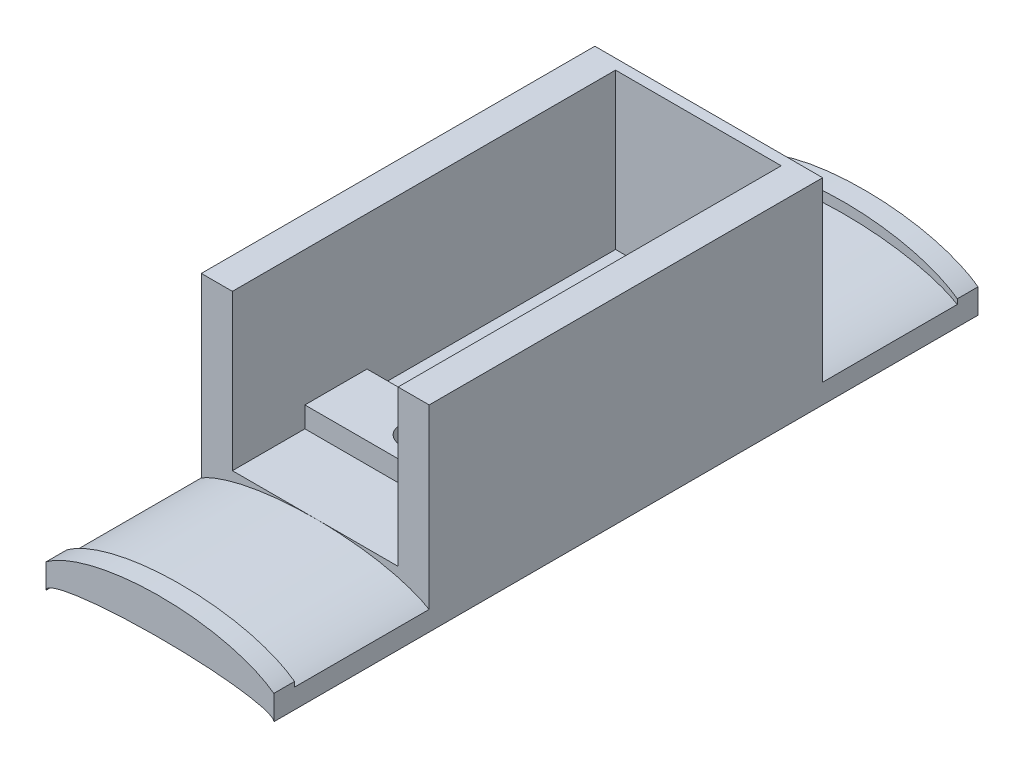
ISO-10303-21;
HEADER;
FILE_DESCRIPTION(('STEP AP214'),'2;1');
FILE_NAME('part.step','',(''),(''),'','','');
FILE_SCHEMA(('AUTOMOTIVE_DESIGN { 1 0 10303 214 1 1 1 1 }'));
ENDSEC;
DATA;
#1=APPLICATION_CONTEXT('core data for automotive mechanical design processes');
#2=APPLICATION_PROTOCOL_DEFINITION('international standard','automotive_design',2000,#1);
#3=PRODUCT_CONTEXT('',#1,'mechanical');
#4=PRODUCT('Part','Part','',(#3));
#5=PRODUCT_RELATED_PRODUCT_CATEGORY('part','',(#4));
#6=PRODUCT_DEFINITION_FORMATION('','',#4);
#7=PRODUCT_DEFINITION_CONTEXT('part definition',#1,'design');
#8=PRODUCT_DEFINITION('design','',#6,#7);
#9=PRODUCT_DEFINITION_SHAPE('','',#8);
#10=(LENGTH_UNIT() NAMED_UNIT(*) SI_UNIT(.MILLI.,.METRE.));
#11=(NAMED_UNIT(*) PLANE_ANGLE_UNIT() SI_UNIT($,.RADIAN.));
#12=(NAMED_UNIT(*) SI_UNIT($,.STERADIAN.) SOLID_ANGLE_UNIT());
#13=UNCERTAINTY_MEASURE_WITH_UNIT(LENGTH_MEASURE(1.E-05),#10,'distance_accuracy_value','');
#14=(GEOMETRIC_REPRESENTATION_CONTEXT(3) GLOBAL_UNCERTAINTY_ASSIGNED_CONTEXT((#13)) GLOBAL_UNIT_ASSIGNED_CONTEXT((#10,
#11,#12)) REPRESENTATION_CONTEXT('',''));
#15=CARTESIAN_POINT('',(0.,0.,0.));
#16=DIRECTION('',(0.,0.,1.));
#17=DIRECTION('',(1.,0.,0.));
#18=AXIS2_PLACEMENT_3D('',#15,#16,#17);
#19=CARTESIAN_POINT('',(0.,4.,0.));
#20=DIRECTION('',(0.,0.,-1.));
#21=DIRECTION('',(-1.,0.,0.));
#22=AXIS2_PLACEMENT_3D('',#19,#20,#21);
#23=PLANE('',#22);
#24=CARTESIAN_POINT('',(-11.,0.,0.));
#25=DIRECTION('',(0.,0.,1.));
#26=DIRECTION('',(1.,0.,0.));
#27=AXIS2_PLACEMENT_3D('',#24,#25,#26);
#28=ELLIPSE('',#27,12.5,4.);
#29=CARTESIAN_POINT('',(0.,1.89989473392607,0.));
#30=VERTEX_POINT('',#29);
#31=CARTESIAN_POINT('',(-11.,4.,0.));
#32=VERTEX_POINT('',#31);
#33=EDGE_CURVE('E59',#30,#32,#28,.T.);
#34=ORIENTED_EDGE('',*,*,#33,.F.);
#35=DIRECTION('',(0.,-1.,0.));
#36=VECTOR('',#35,1.);
#37=CARTESIAN_POINT('',(0.,4.,0.));
#38=LINE('',#37,#36);
#39=CARTESIAN_POINT('',(0.,19.,0.));
#40=VERTEX_POINT('',#39);
#41=EDGE_CURVE('E524',#40,#30,#38,.T.);
#42=ORIENTED_EDGE('',*,*,#41,.F.);
#43=DIRECTION('',(1.,0.,0.));
#44=VECTOR('',#43,1.);
#45=CARTESIAN_POINT('',(-3.,19.,0.));
#46=LINE('',#45,#44);
#47=CARTESIAN_POINT('',(-3.,19.,0.));
#48=VERTEX_POINT('',#47);
#49=EDGE_CURVE('E490',#48,#40,#46,.T.);
#50=ORIENTED_EDGE('',*,*,#49,.F.);
#51=DIRECTION('',(0.,-1.,0.));
#52=VECTOR('',#51,1.);
#53=CARTESIAN_POINT('',(-3.,19.,0.));
#54=LINE('',#53,#52);
#55=CARTESIAN_POINT('',(-3.,4.,0.));
#56=VERTEX_POINT('',#55);
#57=EDGE_CURVE('E502',#48,#56,#54,.T.);
#58=ORIENTED_EDGE('',*,*,#57,.T.);
#59=DIRECTION('',(1.,0.,0.));
#60=VECTOR('',#59,1.);
#61=CARTESIAN_POINT('',(0.,4.,0.));
#62=LINE('',#61,#60);
#63=EDGE_CURVE('E525',#32,#56,#62,.T.);
#64=ORIENTED_EDGE('',*,*,#63,.F.);
#65=EDGE_LOOP('',(#34,#42,#50,#58,#64));
#66=FACE_BOUND('',#65,.T.);
#67=ADVANCED_FACE('F43',(#66),#23,.F.);
#68=CARTESIAN_POINT('',(-11.,0.,-10.));
#69=DIRECTION('',(0.,1.,0.));
#70=DIRECTION('',(0.,0.,1.));
#71=AXIS2_PLACEMENT_3D('',#68,#69,#70);
#72=CYLINDRICAL_SURFACE('',#71,1.75);
#73=CARTESIAN_POINT('',(-11.,6.,-10.));
#74=DIRECTION('',(0.,1.,0.));
#75=DIRECTION('',(0.,0.,1.));
#76=AXIS2_PLACEMENT_3D('',#73,#74,#75);
#77=CIRCLE('',#76,1.75);
#78=CARTESIAN_POINT('',(-11.,6.,-8.25));
#79=VERTEX_POINT('',#78);
#80=EDGE_CURVE('E434',#79,#79,#77,.F.);
#81=ORIENTED_EDGE('',*,*,#80,.F.);
#82=EDGE_LOOP('',(#81));
#83=FACE_BOUND('',#82,.T.);
#84=CARTESIAN_POINT('',(-11.,3.5,-10.));
#85=DIRECTION('',(0.,-1.,0.));
#86=DIRECTION('',(0.,0.,-1.));
#87=AXIS2_PLACEMENT_3D('',#84,#85,#86);
#88=CIRCLE('',#87,1.75);
#89=CARTESIAN_POINT('',(-11.,3.5,-11.75));
#90=VERTEX_POINT('',#89);
#91=EDGE_CURVE('E419',#90,#90,#88,.F.);
#92=ORIENTED_EDGE('',*,*,#91,.F.);
#93=EDGE_LOOP('',(#92));
#94=FACE_BOUND('',#93,.T.);
#95=ADVANCED_FACE('F539',(#83,#94),#72,.F.);
#96=CARTESIAN_POINT('',(0.,4.,0.));
#97=DIRECTION('',(0.,1.,0.));
#98=DIRECTION('',(0.,0.,1.));
#99=AXIS2_PLACEMENT_3D('',#96,#97,#98);
#100=PLANE('',#99);
#101=DIRECTION('',(0.,0.,1.));
#102=VECTOR('',#101,1.);
#103=CARTESIAN_POINT('',(-3.,4.,-37.));
#104=LINE('',#103,#102);
#105=CARTESIAN_POINT('',(-3.,4.,-7.));
#106=VERTEX_POINT('',#105);
#107=EDGE_CURVE('E509',#106,#56,#104,.T.);
#108=ORIENTED_EDGE('',*,*,#107,.F.);
#109=DIRECTION('',(1.,0.,0.));
#110=VECTOR('',#109,1.);
#111=CARTESIAN_POINT('',(0.,4.,-7.));
#112=LINE('',#111,#110);
#113=CARTESIAN_POINT('',(-19.,4.,-7.));
#114=VERTEX_POINT('',#113);
#115=EDGE_CURVE('E456',#114,#106,#112,.T.);
#116=ORIENTED_EDGE('',*,*,#115,.F.);
#117=DIRECTION('',(0.,0.,-1.));
#118=VECTOR('',#117,1.);
#119=CARTESIAN_POINT('',(-19.,4.,0.));
#120=LINE('',#119,#118);
#121=CARTESIAN_POINT('',(-19.,4.,0.));
#122=VERTEX_POINT('',#121);
#123=EDGE_CURVE('E503',#122,#114,#120,.T.);
#124=ORIENTED_EDGE('',*,*,#123,.F.);
#125=EDGE_CURVE('E522',#122,#32,#62,.T.);
#126=ORIENTED_EDGE('',*,*,#125,.T.);
#127=ORIENTED_EDGE('',*,*,#63,.T.);
#128=EDGE_LOOP('',(#108,#116,#124,#126,#127));
#129=FACE_BOUND('',#128,.T.);
#130=ADVANCED_FACE('F541',(#129),#100,.T.);
#131=CARTESIAN_POINT('',(-19.,19.,0.));
#132=DIRECTION('',(-1.,0.,0.));
#133=DIRECTION('',(0.,0.,1.));
#134=AXIS2_PLACEMENT_3D('',#131,#132,#133);
#135=PLANE('',#134);
#136=DIRECTION('',(0.,-1.,0.));
#137=VECTOR('',#136,1.);
#138=CARTESIAN_POINT('',(-19.,6.,-7.));
#139=LINE('',#138,#137);
#140=CARTESIAN_POINT('',(-19.,6.,-7.));
#141=VERTEX_POINT('',#140);
#142=EDGE_CURVE('E477',#141,#114,#139,.T.);
#143=ORIENTED_EDGE('',*,*,#142,.F.);
#144=DIRECTION('',(0.,0.,1.));
#145=VECTOR('',#144,1.);
#146=CARTESIAN_POINT('',(-19.,6.,0.));
#147=LINE('',#146,#145);
#148=CARTESIAN_POINT('',(-19.,6.,-13.));
#149=VERTEX_POINT('',#148);
#150=EDGE_CURVE('E437',#149,#141,#147,.T.);
#151=ORIENTED_EDGE('',*,*,#150,.F.);
#152=DIRECTION('',(0.,-1.,0.));
#153=VECTOR('',#152,1.);
#154=CARTESIAN_POINT('',(-19.,6.,-13.));
#155=LINE('',#154,#153);
#156=CARTESIAN_POINT('',(-19.,4.,-13.));
#157=VERTEX_POINT('',#156);
#158=EDGE_CURVE('E455',#149,#157,#155,.T.);
#159=ORIENTED_EDGE('',*,*,#158,.T.);
#160=CARTESIAN_POINT('',(-19.,4.,-37.));
#161=VERTEX_POINT('',#160);
#162=EDGE_CURVE('E479',#157,#161,#120,.T.);
#163=ORIENTED_EDGE('',*,*,#162,.T.);
#164=DIRECTION('',(0.,-1.,0.));
#165=VECTOR('',#164,1.);
#166=CARTESIAN_POINT('',(-19.,19.,-37.));
#167=LINE('',#166,#165);
#168=CARTESIAN_POINT('',(-19.,19.,-37.));
#169=VERTEX_POINT('',#168);
#170=EDGE_CURVE('E517',#169,#161,#167,.T.);
#171=ORIENTED_EDGE('',*,*,#170,.F.);
#172=DIRECTION('',(0.,0.,-1.));
#173=VECTOR('',#172,1.);
#174=CARTESIAN_POINT('',(-19.,19.,0.));
#175=LINE('',#174,#173);
#176=CARTESIAN_POINT('',(-19.,19.,0.));
#177=VERTEX_POINT('',#176);
#178=EDGE_CURVE('E483',#177,#169,#175,.T.);
#179=ORIENTED_EDGE('',*,*,#178,.F.);
#180=DIRECTION('',(0.,-1.,0.));
#181=VECTOR('',#180,1.);
#182=CARTESIAN_POINT('',(-19.,19.,0.));
#183=LINE('',#182,#181);
#184=EDGE_CURVE('E250',#177,#122,#183,.T.);
#185=ORIENTED_EDGE('',*,*,#184,.T.);
#186=ORIENTED_EDGE('',*,*,#123,.T.);
#187=EDGE_LOOP('',(#143,#151,#159,#163,#171,#179,#185,#186));
#188=FACE_BOUND('',#187,.T.);
#189=ADVANCED_FACE('F549',(#188),#135,.F.);
#190=CARTESIAN_POINT('',(-3.,19.,-37.));
#191=DIRECTION('',(1.,0.,0.));
#192=DIRECTION('',(0.,0.,-1.));
#193=AXIS2_PLACEMENT_3D('',#190,#191,#192);
#194=PLANE('',#193);
#195=DIRECTION('',(0.,-1.,0.));
#196=VECTOR('',#195,1.);
#197=CARTESIAN_POINT('',(-3.,6.,-7.));
#198=LINE('',#197,#196);
#199=CARTESIAN_POINT('',(-3.,6.,-7.));
#200=VERTEX_POINT('',#199);
#201=EDGE_CURVE('E474',#200,#106,#198,.T.);
#202=ORIENTED_EDGE('',*,*,#201,.T.);
#203=ORIENTED_EDGE('',*,*,#107,.T.);
#204=ORIENTED_EDGE('',*,*,#57,.F.);
#205=DIRECTION('',(0.,0.,1.));
#206=VECTOR('',#205,1.);
#207=CARTESIAN_POINT('',(-3.,19.,-37.));
#208=LINE('',#207,#206);
#209=CARTESIAN_POINT('',(-3.,19.,-37.));
#210=VERTEX_POINT('',#209);
#211=EDGE_CURVE('E488',#210,#48,#208,.T.);
#212=ORIENTED_EDGE('',*,*,#211,.F.);
#213=DIRECTION('',(0.,-1.,0.));
#214=VECTOR('',#213,1.);
#215=CARTESIAN_POINT('',(-3.,19.,-37.));
#216=LINE('',#215,#214);
#217=CARTESIAN_POINT('',(-3.,4.,-37.));
#218=VERTEX_POINT('',#217);
#219=EDGE_CURVE('E514',#210,#218,#216,.T.);
#220=ORIENTED_EDGE('',*,*,#219,.T.);
#221=CARTESIAN_POINT('',(-3.,4.,-28.));
#222=VERTEX_POINT('',#221);
#223=EDGE_CURVE('E484',#218,#222,#104,.T.);
#224=ORIENTED_EDGE('',*,*,#223,.T.);
#225=DIRECTION('',(0.,-1.,0.));
#226=VECTOR('',#225,1.);
#227=CARTESIAN_POINT('',(-3.,6.,-28.));
#228=LINE('',#227,#226);
#229=CARTESIAN_POINT('',(-3.,6.,-28.));
#230=VERTEX_POINT('',#229);
#231=EDGE_CURVE('E472',#230,#222,#228,.T.);
#232=ORIENTED_EDGE('',*,*,#231,.F.);
#233=DIRECTION('',(0.,0.,-1.));
#234=VECTOR('',#233,1.);
#235=CARTESIAN_POINT('',(-3.,6.,0.));
#236=LINE('',#235,#234);
#237=EDGE_CURVE('E444',#200,#230,#236,.T.);
#238=ORIENTED_EDGE('',*,*,#237,.F.);
#239=EDGE_LOOP('',(#202,#203,#204,#212,#220,#224,#232,#238));
#240=FACE_BOUND('',#239,.T.);
#241=ADVANCED_FACE('F567',(#240),#194,.F.);
#242=CARTESIAN_POINT('',(0.,4.,0.));
#243=DIRECTION('',(-1.,0.,0.));
#244=DIRECTION('',(0.,0.,1.));
#245=AXIS2_PLACEMENT_3D('',#242,#243,#244);
#246=PLANE('',#245);
#247=DIRECTION('',(0.,0.,-1.));
#248=VECTOR('',#247,1.);
#249=CARTESIAN_POINT('',(0.,0.,0.));
#250=LINE('',#249,#248);
#251=CARTESIAN_POINT('',(0.,0.,15.));
#252=VERTEX_POINT('',#251);
#253=CARTESIAN_POINT('',(0.,0.,-53.));
#254=VERTEX_POINT('',#253);
#255=EDGE_CURVE('E238',#252,#254,#250,.T.);
#256=ORIENTED_EDGE('',*,*,#255,.T.);
#257=DIRECTION('',(0.,-1.,0.));
#258=VECTOR('',#257,1.);
#259=CARTESIAN_POINT('',(0.,0.,-53.));
#260=LINE('',#259,#258);
#261=CARTESIAN_POINT('',(0.,2.37486841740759,-53.));
#262=VERTEX_POINT('',#261);
#263=EDGE_CURVE('E301',#262,#254,#260,.T.);
#264=ORIENTED_EDGE('',*,*,#263,.F.);
#265=DIRECTION('',(0.,0.,1.));
#266=VECTOR('',#265,1.);
#267=CARTESIAN_POINT('',(0.,2.37486841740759,-53.));
#268=LINE('',#267,#266);
#269=CARTESIAN_POINT('',(0.,2.37486841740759,-51.));
#270=VERTEX_POINT('',#269);
#271=EDGE_CURVE('E305',#262,#270,#268,.T.);
#272=ORIENTED_EDGE('',*,*,#271,.T.);
#273=DIRECTION('',(0.,-1.,0.));
#274=VECTOR('',#273,1.);
#275=CARTESIAN_POINT('',(0.,0.,-51.));
#276=LINE('',#275,#274);
#277=CARTESIAN_POINT('',(0.,1.89989473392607,-51.));
#278=VERTEX_POINT('',#277);
#279=EDGE_CURVE('E310',#270,#278,#276,.T.);
#280=ORIENTED_EDGE('',*,*,#279,.T.);
#281=DIRECTION('',(0.,0.,1.));
#282=VECTOR('',#281,1.);
#283=CARTESIAN_POINT('',(0.,1.89989473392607,-51.));
#284=LINE('',#283,#282);
#285=CARTESIAN_POINT('',(0.,1.89989473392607,-38.));
#286=VERTEX_POINT('',#285);
#287=EDGE_CURVE('E321',#278,#286,#284,.T.);
#288=ORIENTED_EDGE('',*,*,#287,.T.);
#289=DIRECTION('',(0.,-1.,0.));
#290=VECTOR('',#289,1.);
#291=CARTESIAN_POINT('',(0.,4.,-38.));
#292=LINE('',#291,#290);
#293=CARTESIAN_POINT('',(0.,19.,-38.));
#294=VERTEX_POINT('',#293);
#295=EDGE_CURVE('E534',#294,#286,#292,.T.);
#296=ORIENTED_EDGE('',*,*,#295,.F.);
#297=DIRECTION('',(0.,0.,-1.));
#298=VECTOR('',#297,1.);
#299=CARTESIAN_POINT('',(0.,19.,0.));
#300=LINE('',#299,#298);
#301=EDGE_CURVE('E493',#40,#294,#300,.T.);
#302=ORIENTED_EDGE('',*,*,#301,.F.);
#303=ORIENTED_EDGE('',*,*,#41,.T.);
#304=DIRECTION('',(0.,0.,-1.));
#305=VECTOR('',#304,1.);
#306=CARTESIAN_POINT('',(0.,1.89989473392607,13.));
#307=LINE('',#306,#305);
#308=CARTESIAN_POINT('',(0.,1.89989473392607,13.));
#309=VERTEX_POINT('',#308);
#310=EDGE_CURVE('E348',#309,#30,#307,.T.);
#311=ORIENTED_EDGE('',*,*,#310,.F.);
#312=DIRECTION('',(0.,1.,0.));
#313=VECTOR('',#312,1.);
#314=CARTESIAN_POINT('',(0.,0.,13.));
#315=LINE('',#314,#313);
#316=CARTESIAN_POINT('',(0.,2.37486841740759,13.));
#317=VERTEX_POINT('',#316);
#318=EDGE_CURVE('E928',#309,#317,#315,.T.);
#319=ORIENTED_EDGE('',*,*,#318,.T.);
#320=DIRECTION('',(0.,0.,-1.));
#321=VECTOR('',#320,1.);
#322=CARTESIAN_POINT('',(0.,2.37486841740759,15.));
#323=LINE('',#322,#321);
#324=CARTESIAN_POINT('',(0.,2.37486841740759,15.));
#325=VERTEX_POINT('',#324);
#326=EDGE_CURVE('E255',#325,#317,#323,.T.);
#327=ORIENTED_EDGE('',*,*,#326,.F.);
#328=DIRECTION('',(0.,1.,0.));
#329=VECTOR('',#328,1.);
#330=CARTESIAN_POINT('',(0.,0.,15.));
#331=LINE('',#330,#329);
#332=EDGE_CURVE('E253',#252,#325,#331,.T.);
#333=ORIENTED_EDGE('',*,*,#332,.F.);
#334=EDGE_LOOP('',(#256,#264,#272,#280,#288,#296,#302,#303,#311,#319,#327,#333));
#335=FACE_BOUND('',#334,.T.);
#336=ADVANCED_FACE('F45',(#335),#246,.F.);
#337=CARTESIAN_POINT('',(0.,4.,-38.));
#338=DIRECTION('',(0.,0.,1.));
#339=DIRECTION('',(1.,0.,0.));
#340=AXIS2_PLACEMENT_3D('',#337,#338,#339);
#341=PLANE('',#340);
#342=CARTESIAN_POINT('',(-11.,0.,-38.));
#343=DIRECTION('',(0.,0.,-1.));
#344=DIRECTION('',(-1.,0.,0.));
#345=AXIS2_PLACEMENT_3D('',#342,#343,#344);
#346=ELLIPSE('',#345,12.5,4.);
#347=CARTESIAN_POINT('',(-22.,1.89989473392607,-38.));
#348=VERTEX_POINT('',#347);
#349=EDGE_CURVE('E66',#348,#286,#346,.T.);
#350=ORIENTED_EDGE('',*,*,#349,.F.);
#351=DIRECTION('',(0.,-1.,0.));
#352=VECTOR('',#351,1.);
#353=CARTESIAN_POINT('',(-22.,4.,-38.));
#354=LINE('',#353,#352);
#355=CARTESIAN_POINT('',(-22.,19.,-38.));
#356=VERTEX_POINT('',#355);
#357=EDGE_CURVE('E532',#356,#348,#354,.T.);
#358=ORIENTED_EDGE('',*,*,#357,.F.);
#359=DIRECTION('',(-1.,0.,0.));
#360=VECTOR('',#359,1.);
#361=CARTESIAN_POINT('',(0.,19.,-38.));
#362=LINE('',#361,#360);
#363=EDGE_CURVE('E496',#294,#356,#362,.T.);
#364=ORIENTED_EDGE('',*,*,#363,.F.);
#365=ORIENTED_EDGE('',*,*,#295,.T.);
#366=EDGE_LOOP('',(#350,#358,#364,#365));
#367=FACE_BOUND('',#366,.T.);
#368=ADVANCED_FACE('F582',(#367),#341,.F.);
#369=CARTESIAN_POINT('',(-22.,4.,0.));
#370=DIRECTION('',(1.,0.,0.));
#371=DIRECTION('',(0.,0.,-1.));
#372=AXIS2_PLACEMENT_3D('',#369,#370,#371);
#373=PLANE('',#372);
#374=DIRECTION('',(0.,0.,1.));
#375=VECTOR('',#374,1.);
#376=CARTESIAN_POINT('',(-22.,0.,0.));
#377=LINE('',#376,#375);
#378=CARTESIAN_POINT('',(-22.,0.,-53.));
#379=VERTEX_POINT('',#378);
#380=CARTESIAN_POINT('',(-22.,0.,15.));
#381=VERTEX_POINT('',#380);
#382=EDGE_CURVE('E249',#379,#381,#377,.T.);
#383=ORIENTED_EDGE('',*,*,#382,.T.);
#384=DIRECTION('',(0.,-1.,0.));
#385=VECTOR('',#384,1.);
#386=CARTESIAN_POINT('',(-22.,0.,15.));
#387=LINE('',#386,#385);
#388=CARTESIAN_POINT('',(-22.,2.37486841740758,15.));
#389=VERTEX_POINT('',#388);
#390=EDGE_CURVE('E263',#389,#381,#387,.T.);
#391=ORIENTED_EDGE('',*,*,#390,.F.);
#392=DIRECTION('',(0.,0.,-1.));
#393=VECTOR('',#392,1.);
#394=CARTESIAN_POINT('',(-22.,2.37486841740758,15.));
#395=LINE('',#394,#393);
#396=CARTESIAN_POINT('',(-22.,2.37486841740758,13.));
#397=VERTEX_POINT('',#396);
#398=EDGE_CURVE('E932',#389,#397,#395,.T.);
#399=ORIENTED_EDGE('',*,*,#398,.T.);
#400=DIRECTION('',(0.,-1.,0.));
#401=VECTOR('',#400,1.);
#402=CARTESIAN_POINT('',(-22.,0.,13.));
#403=LINE('',#402,#401);
#404=CARTESIAN_POINT('',(-22.,1.89989473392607,13.));
#405=VERTEX_POINT('',#404);
#406=EDGE_CURVE('E264',#397,#405,#403,.T.);
#407=ORIENTED_EDGE('',*,*,#406,.T.);
#408=DIRECTION('',(0.,0.,-1.));
#409=VECTOR('',#408,1.);
#410=CARTESIAN_POINT('',(-22.,1.89989473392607,13.));
#411=LINE('',#410,#409);
#412=CARTESIAN_POINT('',(-22.,1.89989473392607,0.));
#413=VERTEX_POINT('',#412);
#414=EDGE_CURVE('E331',#405,#413,#411,.T.);
#415=ORIENTED_EDGE('',*,*,#414,.T.);
#416=DIRECTION('',(0.,-1.,0.));
#417=VECTOR('',#416,1.);
#418=CARTESIAN_POINT('',(-22.,4.,0.));
#419=LINE('',#418,#417);
#420=CARTESIAN_POINT('',(-22.,19.,0.));
#421=VERTEX_POINT('',#420);
#422=EDGE_CURVE('E530',#421,#413,#419,.T.);
#423=ORIENTED_EDGE('',*,*,#422,.F.);
#424=DIRECTION('',(0.,0.,1.));
#425=VECTOR('',#424,1.);
#426=CARTESIAN_POINT('',(-22.,19.,-38.));
#427=LINE('',#426,#425);
#428=EDGE_CURVE('E499',#356,#421,#427,.T.);
#429=ORIENTED_EDGE('',*,*,#428,.F.);
#430=ORIENTED_EDGE('',*,*,#357,.T.);
#431=DIRECTION('',(0.,0.,1.));
#432=VECTOR('',#431,1.);
#433=CARTESIAN_POINT('',(-22.,1.89989473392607,-51.));
#434=LINE('',#433,#432);
#435=CARTESIAN_POINT('',(-22.,1.89989473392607,-51.));
#436=VERTEX_POINT('',#435);
#437=EDGE_CURVE('E325',#436,#348,#434,.T.);
#438=ORIENTED_EDGE('',*,*,#437,.F.);
#439=DIRECTION('',(0.,1.,0.));
#440=VECTOR('',#439,1.);
#441=CARTESIAN_POINT('',(-22.,0.,-51.));
#442=LINE('',#441,#440);
#443=CARTESIAN_POINT('',(-22.,2.37486841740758,-51.));
#444=VERTEX_POINT('',#443);
#445=EDGE_CURVE('E306',#436,#444,#442,.T.);
#446=ORIENTED_EDGE('',*,*,#445,.T.);
#447=DIRECTION('',(0.,0.,1.));
#448=VECTOR('',#447,1.);
#449=CARTESIAN_POINT('',(-22.,2.37486841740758,-53.));
#450=LINE('',#449,#448);
#451=CARTESIAN_POINT('',(-22.,2.37486841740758,-53.));
#452=VERTEX_POINT('',#451);
#453=EDGE_CURVE('E315',#452,#444,#450,.T.);
#454=ORIENTED_EDGE('',*,*,#453,.F.);
#455=DIRECTION('',(0.,1.,0.));
#456=VECTOR('',#455,1.);
#457=CARTESIAN_POINT('',(-22.,0.,-53.));
#458=LINE('',#457,#456);
#459=EDGE_CURVE('E302',#379,#452,#458,.T.);
#460=ORIENTED_EDGE('',*,*,#459,.F.);
#461=EDGE_LOOP('',(#383,#391,#399,#407,#415,#423,#429,#430,#438,#446,#454,#460));
#462=FACE_BOUND('',#461,.T.);
#463=ADVANCED_FACE('F580',(#462),#373,.F.);
#464=EDGE_CURVE('E11',#32,#413,#28,.T.);
#465=ORIENTED_EDGE('',*,*,#464,.F.);
#466=ORIENTED_EDGE('',*,*,#125,.F.);
#467=ORIENTED_EDGE('',*,*,#184,.F.);
#468=DIRECTION('',(1.,0.,0.));
#469=VECTOR('',#468,1.);
#470=CARTESIAN_POINT('',(-22.,19.,0.));
#471=LINE('',#470,#469);
#472=EDGE_CURVE('E480',#421,#177,#471,.T.);
#473=ORIENTED_EDGE('',*,*,#472,.F.);
#474=ORIENTED_EDGE('',*,*,#422,.T.);
#475=EDGE_LOOP('',(#465,#466,#467,#473,#474));
#476=FACE_BOUND('',#475,.T.);
#477=ADVANCED_FACE('F556',(#476),#23,.F.);
#478=DIRECTION('',(1.,0.,0.));
#479=VECTOR('',#478,1.);
#480=CARTESIAN_POINT('',(0.,4.,-28.));
#481=LINE('',#480,#479);
#482=CARTESIAN_POINT('',(-11.,4.,-28.));
#483=VERTEX_POINT('',#482);
#484=EDGE_CURVE('E458',#483,#222,#481,.T.);
#485=ORIENTED_EDGE('',*,*,#484,.T.);
#486=ORIENTED_EDGE('',*,*,#223,.F.);
#487=DIRECTION('',(1.,0.,0.));
#488=VECTOR('',#487,1.);
#489=CARTESIAN_POINT('',(-19.,4.,-37.));
#490=LINE('',#489,#488);
#491=EDGE_CURVE('E506',#161,#218,#490,.T.);
#492=ORIENTED_EDGE('',*,*,#491,.F.);
#493=ORIENTED_EDGE('',*,*,#162,.F.);
#494=DIRECTION('',(1.,0.,0.));
#495=VECTOR('',#494,1.);
#496=CARTESIAN_POINT('',(0.,4.,-13.));
#497=LINE('',#496,#495);
#498=CARTESIAN_POINT('',(-11.,4.,-13.));
#499=VERTEX_POINT('',#498);
#500=EDGE_CURVE('E438',#157,#499,#497,.T.);
#501=ORIENTED_EDGE('',*,*,#500,.T.);
#502=DIRECTION('',(0.,0.,-1.));
#503=VECTOR('',#502,1.);
#504=CARTESIAN_POINT('',(-11.,4.,0.));
#505=LINE('',#504,#503);
#506=EDGE_CURVE('E461',#499,#483,#505,.T.);
#507=ORIENTED_EDGE('',*,*,#506,.T.);
#508=EDGE_LOOP('',(#485,#486,#492,#493,#501,#507));
#509=FACE_BOUND('',#508,.T.);
#510=ADVANCED_FACE('F552',(#509),#100,.T.);
#511=CARTESIAN_POINT('',(-19.,19.,-37.));
#512=DIRECTION('',(0.,0.,-1.));
#513=DIRECTION('',(-1.,0.,0.));
#514=AXIS2_PLACEMENT_3D('',#511,#512,#513);
#515=PLANE('',#514);
#516=ORIENTED_EDGE('',*,*,#491,.T.);
#517=ORIENTED_EDGE('',*,*,#219,.F.);
#518=DIRECTION('',(1.,0.,0.));
#519=VECTOR('',#518,1.);
#520=CARTESIAN_POINT('',(-19.,19.,-37.));
#521=LINE('',#520,#519);
#522=EDGE_CURVE('E486',#169,#210,#521,.T.);
#523=ORIENTED_EDGE('',*,*,#522,.F.);
#524=ORIENTED_EDGE('',*,*,#170,.T.);
#525=EDGE_LOOP('',(#516,#517,#523,#524));
#526=FACE_BOUND('',#525,.T.);
#527=ADVANCED_FACE('F565',(#526),#515,.F.);
#528=CARTESIAN_POINT('',(0.,19.,0.));
#529=DIRECTION('',(0.,1.,0.));
#530=DIRECTION('',(0.,0.,1.));
#531=AXIS2_PLACEMENT_3D('',#528,#529,#530);
#532=PLANE('',#531);
#533=ORIENTED_EDGE('',*,*,#472,.T.);
#534=ORIENTED_EDGE('',*,*,#178,.T.);
#535=ORIENTED_EDGE('',*,*,#522,.T.);
#536=ORIENTED_EDGE('',*,*,#211,.T.);
#537=ORIENTED_EDGE('',*,*,#49,.T.);
#538=ORIENTED_EDGE('',*,*,#301,.T.);
#539=ORIENTED_EDGE('',*,*,#363,.T.);
#540=ORIENTED_EDGE('',*,*,#428,.T.);
#541=EDGE_LOOP('',(#533,#534,#535,#536,#537,#538,#539,#540));
#542=FACE_BOUND('',#541,.T.);
#543=ADVANCED_FACE('F562',(#542),#532,.T.);
#544=CARTESIAN_POINT('',(0.,6.,-7.));
#545=DIRECTION('',(0.,0.,-1.));
#546=DIRECTION('',(-1.,0.,0.));
#547=AXIS2_PLACEMENT_3D('',#544,#545,#546);
#548=PLANE('',#547);
#549=ORIENTED_EDGE('',*,*,#115,.T.);
#550=ORIENTED_EDGE('',*,*,#201,.F.);
#551=DIRECTION('',(1.,0.,0.));
#552=VECTOR('',#551,1.);
#553=CARTESIAN_POINT('',(0.,6.,-7.));
#554=LINE('',#553,#552);
#555=EDGE_CURVE('E441',#141,#200,#554,.T.);
#556=ORIENTED_EDGE('',*,*,#555,.F.);
#557=ORIENTED_EDGE('',*,*,#142,.T.);
#558=EDGE_LOOP('',(#549,#550,#556,#557));
#559=FACE_BOUND('',#558,.T.);
#560=ADVANCED_FACE('F560',(#559),#548,.F.);
#561=CARTESIAN_POINT('',(0.,6.,-28.));
#562=DIRECTION('',(0.,0.,-1.));
#563=DIRECTION('',(-1.,0.,0.));
#564=AXIS2_PLACEMENT_3D('',#561,#562,#563);
#565=PLANE('',#564);
#566=ORIENTED_EDGE('',*,*,#484,.F.);
#567=DIRECTION('',(0.,-1.,0.));
#568=VECTOR('',#567,1.);
#569=CARTESIAN_POINT('',(-11.,6.,-28.));
#570=LINE('',#569,#568);
#571=CARTESIAN_POINT('',(-11.,6.,-28.));
#572=VERTEX_POINT('',#571);
#573=EDGE_CURVE('E470',#572,#483,#570,.T.);
#574=ORIENTED_EDGE('',*,*,#573,.F.);
#575=DIRECTION('',(1.,0.,0.));
#576=VECTOR('',#575,1.);
#577=CARTESIAN_POINT('',(0.,6.,-28.));
#578=LINE('',#577,#576);
#579=EDGE_CURVE('E446',#572,#230,#578,.T.);
#580=ORIENTED_EDGE('',*,*,#579,.T.);
#581=ORIENTED_EDGE('',*,*,#231,.T.);
#582=EDGE_LOOP('',(#566,#574,#580,#581));
#583=FACE_BOUND('',#582,.T.);
#584=ADVANCED_FACE('F751',(#583),#565,.T.);
#585=CARTESIAN_POINT('',(-11.,6.,0.));
#586=DIRECTION('',(-1.,0.,0.));
#587=DIRECTION('',(0.,0.,1.));
#588=AXIS2_PLACEMENT_3D('',#585,#586,#587);
#589=PLANE('',#588);
#590=ORIENTED_EDGE('',*,*,#506,.F.);
#591=DIRECTION('',(0.,-1.,0.));
#592=VECTOR('',#591,1.);
#593=CARTESIAN_POINT('',(-11.,6.,-13.));
#594=LINE('',#593,#592);
#595=CARTESIAN_POINT('',(-11.,6.,-13.));
#596=VERTEX_POINT('',#595);
#597=EDGE_CURVE('E468',#596,#499,#594,.T.);
#598=ORIENTED_EDGE('',*,*,#597,.F.);
#599=DIRECTION('',(0.,0.,-1.));
#600=VECTOR('',#599,1.);
#601=CARTESIAN_POINT('',(-11.,6.,0.));
#602=LINE('',#601,#600);
#603=EDGE_CURVE('E449',#596,#572,#602,.T.);
#604=ORIENTED_EDGE('',*,*,#603,.T.);
#605=ORIENTED_EDGE('',*,*,#573,.T.);
#606=EDGE_LOOP('',(#590,#598,#604,#605));
#607=FACE_BOUND('',#606,.T.);
#608=ADVANCED_FACE('F743',(#607),#589,.T.);
#609=CARTESIAN_POINT('',(0.,6.,-13.));
#610=DIRECTION('',(0.,0.,-1.));
#611=DIRECTION('',(-1.,0.,0.));
#612=AXIS2_PLACEMENT_3D('',#609,#610,#611);
#613=PLANE('',#612);
#614=ORIENTED_EDGE('',*,*,#500,.F.);
#615=ORIENTED_EDGE('',*,*,#158,.F.);
#616=DIRECTION('',(1.,0.,0.));
#617=VECTOR('',#616,1.);
#618=CARTESIAN_POINT('',(0.,6.,-13.));
#619=LINE('',#618,#617);
#620=EDGE_CURVE('E452',#149,#596,#619,.T.);
#621=ORIENTED_EDGE('',*,*,#620,.T.);
#622=ORIENTED_EDGE('',*,*,#597,.T.);
#623=EDGE_LOOP('',(#614,#615,#621,#622));
#624=FACE_BOUND('',#623,.T.);
#625=ADVANCED_FACE('F733',(#624),#613,.T.);
#626=CARTESIAN_POINT('',(0.,6.,0.));
#627=DIRECTION('',(0.,1.,0.));
#628=DIRECTION('',(0.,0.,1.));
#629=AXIS2_PLACEMENT_3D('',#626,#627,#628);
#630=PLANE('',#629);
#631=ORIENTED_EDGE('',*,*,#80,.T.);
#632=EDGE_LOOP('',(#631));
#633=FACE_BOUND('',#632,.T.);
#634=ORIENTED_EDGE('',*,*,#150,.T.);
#635=ORIENTED_EDGE('',*,*,#555,.T.);
#636=ORIENTED_EDGE('',*,*,#237,.T.);
#637=ORIENTED_EDGE('',*,*,#579,.F.);
#638=ORIENTED_EDGE('',*,*,#603,.F.);
#639=ORIENTED_EDGE('',*,*,#620,.F.);
#640=EDGE_LOOP('',(#634,#635,#636,#637,#638,#639));
#641=FACE_BOUND('',#640,.T.);
#642=ADVANCED_FACE('F381',(#633,#641),#630,.T.);
#643=CARTESIAN_POINT('',(0.,3.5,0.));
#644=DIRECTION('',(0.,-1.,0.));
#645=DIRECTION('',(0.,0.,-1.));
#646=AXIS2_PLACEMENT_3D('',#643,#644,#645);
#647=PLANE('',#646);
#648=DIRECTION('',(-0.747230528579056,0.,0.66456492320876));
#649=VECTOR('',#648,1.);
#650=CARTESIAN_POINT('',(-7.71206398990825,3.5,-8.90936862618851));
#651=LINE('',#650,#649);
#652=CARTESIAN_POINT('',(-7.71206398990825,3.5,-8.90936862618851));
#653=VERTEX_POINT('',#652);
#654=CARTESIAN_POINT('',(-10.3005464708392,3.5,-6.60724820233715));
#655=VERTEX_POINT('',#654);
#656=EDGE_CURVE('E392',#653,#655,#651,.T.);
#657=ORIENTED_EDGE('',*,*,#656,.T.);
#658=DIRECTION('',(-0.949145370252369,0.,-0.314838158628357));
#659=VECTOR('',#658,1.);
#660=CARTESIAN_POINT('',(-10.3005464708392,3.5,-6.60724820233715));
#661=LINE('',#660,#659);
#662=CARTESIAN_POINT('',(-13.588482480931,3.5,-7.69787957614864));
#663=VERTEX_POINT('',#662);
#664=EDGE_CURVE('E400',#655,#663,#661,.T.);
#665=ORIENTED_EDGE('',*,*,#664,.T.);
#666=DIRECTION('',(-0.201914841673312,0.,-0.979403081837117));
#667=VECTOR('',#666,1.);
#668=CARTESIAN_POINT('',(-13.588482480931,3.5,-7.69787957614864));
#669=LINE('',#668,#667);
#670=CARTESIAN_POINT('',(-14.2879360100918,3.5,-11.0906313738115));
#671=VERTEX_POINT('',#670);
#672=EDGE_CURVE('E403',#663,#671,#669,.T.);
#673=ORIENTED_EDGE('',*,*,#672,.T.);
#674=DIRECTION('',(0.747230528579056,0.,-0.664564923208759));
#675=VECTOR('',#674,1.);
#676=CARTESIAN_POINT('',(-14.2879360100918,3.5,-11.0906313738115));
#677=LINE('',#676,#675);
#678=CARTESIAN_POINT('',(-11.6994535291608,3.5,-13.3927517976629));
#679=VERTEX_POINT('',#678);
#680=EDGE_CURVE('E406',#671,#679,#677,.T.);
#681=ORIENTED_EDGE('',*,*,#680,.T.);
#682=DIRECTION('',(0.949145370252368,0.,0.314838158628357));
#683=VECTOR('',#682,1.);
#684=CARTESIAN_POINT('',(-11.6994535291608,3.5,-13.3927517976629));
#685=LINE('',#684,#683);
#686=CARTESIAN_POINT('',(-8.41151751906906,3.5,-12.3021204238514));
#687=VERTEX_POINT('',#686);
#688=EDGE_CURVE('E409',#679,#687,#685,.T.);
#689=ORIENTED_EDGE('',*,*,#688,.T.);
#690=DIRECTION('',(0.201914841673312,0.,0.979403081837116));
#691=VECTOR('',#690,1.);
#692=CARTESIAN_POINT('',(-8.41151751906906,3.5,-12.3021204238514));
#693=LINE('',#692,#691);
#694=EDGE_CURVE('E412',#687,#653,#693,.T.);
#695=ORIENTED_EDGE('',*,*,#694,.T.);
#696=EDGE_LOOP('',(#657,#665,#673,#681,#689,#695));
#697=FACE_BOUND('',#696,.T.);
#698=ORIENTED_EDGE('',*,*,#91,.T.);
#699=EDGE_LOOP('',(#698));
#700=FACE_BOUND('',#699,.T.);
#701=ADVANCED_FACE('F341',(#697,#700),#647,.T.);
#702=CARTESIAN_POINT('',(-7.71206398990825,3.5,-8.90936862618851));
#703=DIRECTION('',(0.66456492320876,0.,0.747230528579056));
#704=DIRECTION('',(0.747230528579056,0.,-0.66456492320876));
#705=AXIS2_PLACEMENT_3D('',#702,#703,#704);
#706=PLANE('',#705);
#707=DIRECTION('',(0.,-1.,0.));
#708=VECTOR('',#707,1.);
#709=CARTESIAN_POINT('',(-7.71206398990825,3.5,-8.90936862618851));
#710=LINE('',#709,#708);
#711=CARTESIAN_POINT('',(-7.71206398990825,1.43142512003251,-8.90936862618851));
#712=VERTEX_POINT('',#711);
#713=EDGE_CURVE('E416',#653,#712,#710,.T.);
#714=ORIENTED_EDGE('',*,*,#713,.T.);
#715=CARTESIAN_POINT('',(-7.71206398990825,1.43142512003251,-8.90936862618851));
#716=CARTESIAN_POINT('',(-7.85582940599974,1.43756463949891,-8.78150788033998));
#717=CARTESIAN_POINT('',(-7.9996052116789,1.4432643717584,-8.65363789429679));
#718=CARTESIAN_POINT('',(-8.2871690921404,1.45381005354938,-8.39788701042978));
#719=CARTESIAN_POINT('',(-8.43095716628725,1.45865603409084,-8.27000611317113));
#720=CARTESIAN_POINT('',(-8.71854504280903,1.46752037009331,-8.01423388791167));
#721=CARTESIAN_POINT('',(-8.86234484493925,1.47153873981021,-7.88634256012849));
#722=CARTESIAN_POINT('',(-9.14995562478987,1.47876740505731,-7.63054996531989));
#723=CARTESIAN_POINT('',(-9.29376660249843,1.48197770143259,-7.502648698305));
#724=CARTESIAN_POINT('',(-9.58139982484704,1.48760596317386,-7.24683614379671));
#725=CARTESIAN_POINT('',(-9.72522206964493,1.49002391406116,-7.11892485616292));
#726=CARTESIAN_POINT('',(-10.0128777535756,1.49407799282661,-6.86309232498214));
#727=CARTESIAN_POINT('',(-10.156711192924,1.49571409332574,-6.73517108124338));
#728=CARTESIAN_POINT('',(-10.3005464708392,1.49696447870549,-6.60724820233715));
#729=B_SPLINE_CURVE_WITH_KNOTS('',3,(#715,#716,#717,#718,#719,#720,#721,#722,#723,#724,#725,
#726,#727,#728),.UNSPECIFIED.,.F.,.F.,(4,2,2,2,2,2,4),(0.,0.577486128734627,1.15495127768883,
1.73240647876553,2.30986107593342,2.88732622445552,3.46481159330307),.UNSPECIFIED.);
#730=CARTESIAN_POINT('',(-10.3005464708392,1.49696447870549,-6.60724820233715));
#731=VERTEX_POINT('',#730);
#732=EDGE_CURVE('E384',#712,#731,#729,.T.);
#733=ORIENTED_EDGE('',*,*,#732,.T.);
#734=DIRECTION('',(0.,-1.,0.));
#735=VECTOR('',#734,1.);
#736=CARTESIAN_POINT('',(-10.3005464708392,3.5,-6.60724820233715));
#737=LINE('',#736,#735);
#738=EDGE_CURVE('E415',#655,#731,#737,.T.);
#739=ORIENTED_EDGE('',*,*,#738,.F.);
#740=ORIENTED_EDGE('',*,*,#656,.F.);
#741=EDGE_LOOP('',(#714,#733,#739,#740));
#742=FACE_BOUND('',#741,.T.);
#743=ADVANCED_FACE('F375',(#742),#706,.F.);
#744=CARTESIAN_POINT('',(-8.41151751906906,3.5,-12.3021204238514));
#745=DIRECTION('',(0.979403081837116,0.,-0.201914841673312));
#746=DIRECTION('',(-0.201914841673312,0.,-0.979403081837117));
#747=AXIS2_PLACEMENT_3D('',#744,#745,#746);
#748=PLANE('',#747);
#749=DIRECTION('',(0.,-1.,0.));
#750=VECTOR('',#749,1.);
#751=CARTESIAN_POINT('',(-8.41151751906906,3.5,-12.3021204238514));
#752=LINE('',#751,#750);
#753=CARTESIAN_POINT('',(-8.41151751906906,1.45787816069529,-12.3021204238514));
#754=VERTEX_POINT('',#753);
#755=EDGE_CURVE('E420',#687,#754,#752,.T.);
#756=ORIENTED_EDGE('',*,*,#755,.T.);
#757=CARTESIAN_POINT('',(-8.41151751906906,1.45787816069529,-12.3021204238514));
#758=CARTESIAN_POINT('',(-8.29494105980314,1.45403425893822,-11.7366575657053));
#759=CARTESIAN_POINT('',(-8.17836503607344,1.44990788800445,-11.1711968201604));
#760=CARTESIAN_POINT('',(-7.94521385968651,1.44109020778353,-10.0402795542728));
#761=CARTESIAN_POINT('',(-7.82863870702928,1.43639889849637,-9.47482303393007));
#762=CARTESIAN_POINT('',(-7.71206398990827,1.43142512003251,-8.90936862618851));
#763=B_SPLINE_CURVE_WITH_KNOTS('',3,(#757,#758,#759,#760,#761,#762),.UNSPECIFIED.,.F.,.F.,(4,2,
4),(0.,1.73210151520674,3.46420303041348),.UNSPECIFIED.);
#764=EDGE_CURVE('E393',#754,#712,#763,.T.);
#765=ORIENTED_EDGE('',*,*,#764,.T.);
#766=ORIENTED_EDGE('',*,*,#713,.F.);
#767=ORIENTED_EDGE('',*,*,#694,.F.);
#768=EDGE_LOOP('',(#756,#765,#766,#767));
#769=FACE_BOUND('',#768,.T.);
#770=ADVANCED_FACE('F379',(#769),#748,.F.);
#771=CARTESIAN_POINT('',(-11.6994535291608,3.5,-13.3927517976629));
#772=DIRECTION('',(0.314838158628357,0.,-0.949145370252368));
#773=DIRECTION('',(-0.949145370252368,0.,-0.314838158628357));
#774=AXIS2_PLACEMENT_3D('',#771,#772,#773);
#775=PLANE('',#774);
#776=DIRECTION('',(0.,-1.,0.));
#777=VECTOR('',#776,1.);
#778=CARTESIAN_POINT('',(-11.6994535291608,3.5,-13.3927517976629));
#779=LINE('',#778,#777);
#780=CARTESIAN_POINT('',(-11.6994535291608,1.49696447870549,-13.3927517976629));
#781=VERTEX_POINT('',#780);
#782=EDGE_CURVE('E423',#679,#781,#779,.T.);
#783=ORIENTED_EDGE('',*,*,#782,.T.);
#784=CARTESIAN_POINT('',(-11.6994535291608,1.49696447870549,-13.3927517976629));
#785=CARTESIAN_POINT('',(-11.5167602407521,1.49855019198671,-13.3321511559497));
#786=CARTESIAN_POINT('',(-11.3340621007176,1.49951470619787,-13.2715489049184));
#787=CARTESIAN_POINT('',(-10.9686793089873,1.50020123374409,-13.1503488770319));
#788=CARTESIAN_POINT('',(-10.7859946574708,1.49992335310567,-13.0897511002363));
#789=CARTESIAN_POINT('',(-10.420638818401,1.4981252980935,-12.9685600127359));
#790=CARTESIAN_POINT('',(-10.2379676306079,1.49660517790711,-12.9079667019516));
#791=CARTESIAN_POINT('',(-9.87263823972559,1.49231088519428,-12.7867843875));
#792=CARTESIAN_POINT('',(-9.68998003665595,1.48953671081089,-12.7261953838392));
#793=CARTESIAN_POINT('',(-9.32467727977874,1.48271428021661,-12.6050219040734));
#794=CARTESIAN_POINT('',(-9.14203272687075,1.47866597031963,-12.5444374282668));
#795=CARTESIAN_POINT('',(-8.77675805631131,1.46926143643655,-12.423273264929));
#796=CARTESIAN_POINT('',(-8.59412794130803,1.46390509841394,-12.3626935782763));
#797=CARTESIAN_POINT('',(-8.41151751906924,1.45787816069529,-12.3021204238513));
#798=B_SPLINE_CURVE_WITH_KNOTS('',3,(#784,#785,#786,#787,#788,#789,#790,#791,#792,#793,#794,
#795,#796,#797),.UNSPECIFIED.,.F.,.F.,(4,2,2,2,2,2,4),(0.,0.577464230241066,1.15487918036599,
1.73226894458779,2.30965956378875,2.88707451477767,3.46453982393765),.UNSPECIFIED.);
#799=EDGE_CURVE('E958',#781,#754,#798,.T.);
#800=ORIENTED_EDGE('',*,*,#799,.T.);
#801=ORIENTED_EDGE('',*,*,#755,.F.);
#802=ORIENTED_EDGE('',*,*,#688,.F.);
#803=EDGE_LOOP('',(#783,#800,#801,#802));
#804=FACE_BOUND('',#803,.T.);
#805=ADVANCED_FACE('F696',(#804),#775,.F.);
#806=CARTESIAN_POINT('',(-14.2879360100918,3.5,-11.0906313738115));
#807=DIRECTION('',(-0.664564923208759,0.,-0.747230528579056));
#808=DIRECTION('',(-0.747230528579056,0.,0.664564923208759));
#809=AXIS2_PLACEMENT_3D('',#806,#807,#808);
#810=PLANE('',#809);
#811=DIRECTION('',(0.,-1.,0.));
#812=VECTOR('',#811,1.);
#813=CARTESIAN_POINT('',(-14.2879360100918,3.5,-11.0906313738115));
#814=LINE('',#813,#812);
#815=CARTESIAN_POINT('',(-14.2879360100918,1.43142512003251,-11.0906313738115));
#816=VERTEX_POINT('',#815);
#817=EDGE_CURVE('E426',#671,#816,#814,.T.);
#818=ORIENTED_EDGE('',*,*,#817,.T.);
#819=CARTESIAN_POINT('',(-14.2879360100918,1.43142512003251,-11.0906313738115));
#820=CARTESIAN_POINT('',(-14.1441705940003,1.43756463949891,-11.21849211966));
#821=CARTESIAN_POINT('',(-14.0003947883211,1.4432643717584,-11.3463621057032));
#822=CARTESIAN_POINT('',(-13.7128309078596,1.45381005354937,-11.6021129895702));
#823=CARTESIAN_POINT('',(-13.5690428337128,1.45865603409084,-11.7299938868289));
#824=CARTESIAN_POINT('',(-13.281454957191,1.46752037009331,-11.9857661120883));
#825=CARTESIAN_POINT('',(-13.1376551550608,1.47153873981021,-12.1136574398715));
#826=CARTESIAN_POINT('',(-12.8500443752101,1.47876740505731,-12.3694500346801));
#827=CARTESIAN_POINT('',(-12.7062333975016,1.48197770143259,-12.497351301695));
#828=CARTESIAN_POINT('',(-12.418600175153,1.48760596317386,-12.7531638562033));
#829=CARTESIAN_POINT('',(-12.2747779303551,1.49002391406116,-12.8810751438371));
#830=CARTESIAN_POINT('',(-11.9871222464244,1.49407799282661,-13.1369076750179));
#831=CARTESIAN_POINT('',(-11.8432888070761,1.49571409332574,-13.2648289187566));
#832=CARTESIAN_POINT('',(-11.6994535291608,1.49696447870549,-13.3927517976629));
#833=B_SPLINE_CURVE_WITH_KNOTS('',3,(#819,#820,#821,#822,#823,#824,#825,#826,#827,#828,#829,
#830,#831,#832),.UNSPECIFIED.,.F.,.F.,(4,2,2,2,2,2,4),(0.,0.577486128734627,1.15495127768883,
1.73240647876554,2.30986107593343,2.88732622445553,3.46481159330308),.UNSPECIFIED.);
#834=EDGE_CURVE('E357',#816,#781,#833,.T.);
#835=ORIENTED_EDGE('',*,*,#834,.T.);
#836=ORIENTED_EDGE('',*,*,#782,.F.);
#837=ORIENTED_EDGE('',*,*,#680,.F.);
#838=EDGE_LOOP('',(#818,#835,#836,#837));
#839=FACE_BOUND('',#838,.T.);
#840=ADVANCED_FACE('F367',(#839),#810,.F.);
#841=CARTESIAN_POINT('',(-13.588482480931,3.5,-7.69787957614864));
#842=DIRECTION('',(-0.979403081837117,0.,0.201914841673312));
#843=DIRECTION('',(0.201914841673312,0.,0.979403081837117));
#844=AXIS2_PLACEMENT_3D('',#841,#842,#843);
#845=PLANE('',#844);
#846=DIRECTION('',(0.,-1.,0.));
#847=VECTOR('',#846,1.);
#848=CARTESIAN_POINT('',(-13.588482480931,3.5,-7.69787957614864));
#849=LINE('',#848,#847);
#850=CARTESIAN_POINT('',(-13.588482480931,1.45787816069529,-7.69787957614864));
#851=VERTEX_POINT('',#850);
#852=EDGE_CURVE('E429',#663,#851,#849,.T.);
#853=ORIENTED_EDGE('',*,*,#852,.T.);
#854=CARTESIAN_POINT('',(-13.588482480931,1.45787816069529,-7.69787957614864));
#855=CARTESIAN_POINT('',(-13.7050589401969,1.45403425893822,-8.2633424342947));
#856=CARTESIAN_POINT('',(-13.8216349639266,1.44990788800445,-8.82880317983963));
#857=CARTESIAN_POINT('',(-14.0547861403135,1.44109020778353,-9.95972044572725));
#858=CARTESIAN_POINT('',(-14.1713612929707,1.43639889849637,-10.5251769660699));
#859=CARTESIAN_POINT('',(-14.2879360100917,1.43142512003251,-11.0906313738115));
#860=B_SPLINE_CURVE_WITH_KNOTS('',3,(#854,#855,#856,#857,#858,#859),.UNSPECIFIED.,.F.,.F.,(4,2,
4),(0.,1.73210151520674,3.46420303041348),.UNSPECIFIED.);
#861=EDGE_CURVE('E349',#851,#816,#860,.T.);
#862=ORIENTED_EDGE('',*,*,#861,.T.);
#863=ORIENTED_EDGE('',*,*,#817,.F.);
#864=ORIENTED_EDGE('',*,*,#672,.F.);
#865=EDGE_LOOP('',(#853,#862,#863,#864));
#866=FACE_BOUND('',#865,.T.);
#867=ADVANCED_FACE('F364',(#866),#845,.F.);
#868=CARTESIAN_POINT('',(-10.3005464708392,3.5,-6.60724820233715));
#869=DIRECTION('',(-0.314838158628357,0.,0.949145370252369));
#870=DIRECTION('',(0.949145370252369,0.,0.314838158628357));
#871=AXIS2_PLACEMENT_3D('',#868,#869,#870);
#872=PLANE('',#871);
#873=ORIENTED_EDGE('',*,*,#738,.T.);
#874=CARTESIAN_POINT('',(-10.3005464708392,1.49696447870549,-6.60724820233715));
#875=CARTESIAN_POINT('',(-10.5745274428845,1.49933744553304,-6.69812960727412));
#876=CARTESIAN_POINT('',(-10.848519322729,1.50032126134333,-6.78901463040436));
#877=CARTESIAN_POINT('',(-11.3964727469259,1.49949271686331,-6.97077461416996));
#878=CARTESIAN_POINT('',(-11.6704342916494,1.49768062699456,-7.06164957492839));
#879=CARTESIAN_POINT('',(-12.2184334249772,1.49124162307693,-7.24342472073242));
#880=CARTESIAN_POINT('',(-12.4924710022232,1.4866136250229,-7.33432490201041));
#881=CARTESIAN_POINT('',(-13.0405143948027,1.47444985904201,-7.51611472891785));
#882=CARTESIAN_POINT('',(-13.3145202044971,1.46691380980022,-7.60700437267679));
#883=CARTESIAN_POINT('',(-13.5884824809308,1.45787816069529,-7.69787957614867));
#884=B_SPLINE_CURVE_WITH_KNOTS('',3,(#874,#875,#876,#877,#878,#879,#880,#881,#882,#883),
.UNSPECIFIED.,.F.,.F.,(4,2,2,2,4),(0.,0.866008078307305,1.73193240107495,2.59819027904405,
3.46453197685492),.UNSPECIFIED.);
#885=EDGE_CURVE('E47',#731,#851,#884,.T.);
#886=ORIENTED_EDGE('',*,*,#885,.T.);
#887=ORIENTED_EDGE('',*,*,#852,.F.);
#888=ORIENTED_EDGE('',*,*,#664,.F.);
#889=EDGE_LOOP('',(#873,#886,#887,#888));
#890=FACE_BOUND('',#889,.T.);
#891=ADVANCED_FACE('F340',(#890),#872,.F.);
#892=CARTESIAN_POINT('',(-11.,0.,-38.));
#893=DIRECTION('',(0.,0.,1.));
#894=DIRECTION('',(1.,0.,0.));
#895=AXIS2_PLACEMENT_3D('',#892,#893,#894);
#896=ELLIPSE('',#895,11.,1.5);
#897=DIRECTION('',(0.,0.,1.));
#898=VECTOR('',#897,1.);
#899=SURFACE_OF_LINEAR_EXTRUSION('',#896,#898);
#900=ORIENTED_EDGE('',*,*,#255,.F.);
#901=CARTESIAN_POINT('',(-11.,0.,15.));
#902=DIRECTION('',(0.,0.,-1.));
#903=DIRECTION('',(1.,0.,0.));
#904=AXIS2_PLACEMENT_3D('',#901,#902,#903);
#905=ELLIPSE('',#904,11.,1.5);
#906=EDGE_CURVE('E243',#381,#252,#905,.T.);
#907=ORIENTED_EDGE('',*,*,#906,.F.);
#908=ORIENTED_EDGE('',*,*,#382,.F.);
#909=CARTESIAN_POINT('',(-11.,0.,-53.));
#910=DIRECTION('',(0.,0.,1.));
#911=DIRECTION('',(1.,0.,0.));
#912=AXIS2_PLACEMENT_3D('',#909,#910,#911);
#913=ELLIPSE('',#912,11.,1.5);
#914=EDGE_CURVE('E245',#254,#379,#913,.T.);
#915=ORIENTED_EDGE('',*,*,#914,.F.);
#916=EDGE_LOOP('',(#900,#907,#908,#915));
#917=FACE_BOUND('',#916,.T.);
#918=ORIENTED_EDGE('',*,*,#764,.F.);
#919=ORIENTED_EDGE('',*,*,#799,.F.);
#920=ORIENTED_EDGE('',*,*,#834,.F.);
#921=ORIENTED_EDGE('',*,*,#861,.F.);
#922=ORIENTED_EDGE('',*,*,#885,.F.);
#923=ORIENTED_EDGE('',*,*,#732,.F.);
#924=EDGE_LOOP('',(#918,#919,#920,#921,#922,#923));
#925=FACE_BOUND('',#924,.T.);
#926=ADVANCED_FACE('F240',(#917,#925),#899,.F.);
#927=CARTESIAN_POINT('',(-11.,0.,13.));
#928=DIRECTION('',(0.,0.,1.));
#929=DIRECTION('',(1.,0.,0.));
#930=AXIS2_PLACEMENT_3D('',#927,#928,#929);
#931=ELLIPSE('',#930,12.5,4.);
#932=DIRECTION('',(0.,0.,-1.));
#933=VECTOR('',#932,1.);
#934=SURFACE_OF_LINEAR_EXTRUSION('',#931,#933);
#935=ORIENTED_EDGE('',*,*,#33,.T.);
#936=ORIENTED_EDGE('',*,*,#464,.T.);
#937=ORIENTED_EDGE('',*,*,#414,.F.);
#938=EDGE_CURVE('E328',#309,#405,#931,.T.);
#939=ORIENTED_EDGE('',*,*,#938,.F.);
#940=ORIENTED_EDGE('',*,*,#310,.T.);
#941=EDGE_LOOP('',(#935,#936,#937,#939,#940));
#942=FACE_BOUND('',#941,.T.);
#943=ADVANCED_FACE('F333',(#942),#934,.F.);
#944=CARTESIAN_POINT('',(-11.,0.,-51.));
#945=DIRECTION('',(0.,0.,-1.));
#946=DIRECTION('',(-1.,0.,0.));
#947=AXIS2_PLACEMENT_3D('',#944,#945,#946);
#948=ELLIPSE('',#947,12.5,4.);
#949=DIRECTION('',(0.,0.,1.));
#950=VECTOR('',#949,1.);
#951=SURFACE_OF_LINEAR_EXTRUSION('',#948,#950);
#952=ORIENTED_EDGE('',*,*,#349,.T.);
#953=ORIENTED_EDGE('',*,*,#287,.F.);
#954=EDGE_CURVE('E317',#436,#278,#948,.T.);
#955=ORIENTED_EDGE('',*,*,#954,.F.);
#956=ORIENTED_EDGE('',*,*,#437,.T.);
#957=EDGE_LOOP('',(#952,#953,#955,#956));
#958=FACE_BOUND('',#957,.T.);
#959=ADVANCED_FACE('F293',(#958),#951,.F.);
#960=CARTESIAN_POINT('',(-11.,0.,-53.));
#961=DIRECTION('',(0.,0.,-1.));
#962=DIRECTION('',(1.,0.,0.));
#963=AXIS2_PLACEMENT_3D('',#960,#961,#962);
#964=ELLIPSE('',#963,12.5,5.);
#965=DIRECTION('',(0.,0.,1.));
#966=VECTOR('',#965,1.);
#967=SURFACE_OF_LINEAR_EXTRUSION('',#964,#966);
#968=CARTESIAN_POINT('',(-11.,0.,-51.));
#969=DIRECTION('',(0.,0.,-1.));
#970=DIRECTION('',(1.,0.,0.));
#971=AXIS2_PLACEMENT_3D('',#968,#969,#970);
#972=ELLIPSE('',#971,12.5,5.);
#973=EDGE_CURVE('E308',#444,#270,#972,.T.);
#974=ORIENTED_EDGE('',*,*,#973,.T.);
#975=ORIENTED_EDGE('',*,*,#271,.F.);
#976=EDGE_CURVE('E297',#452,#262,#964,.T.);
#977=ORIENTED_EDGE('',*,*,#976,.F.);
#978=ORIENTED_EDGE('',*,*,#453,.T.);
#979=EDGE_LOOP('',(#974,#975,#977,#978));
#980=FACE_BOUND('',#979,.T.);
#981=ADVANCED_FACE('F285',(#980),#967,.F.);
#982=CARTESIAN_POINT('',(0.,0.,-53.));
#983=DIRECTION('',(0.,0.,-1.));
#984=DIRECTION('',(-1.,0.,0.));
#985=AXIS2_PLACEMENT_3D('',#982,#983,#984);
#986=PLANE('',#985);
#987=ORIENTED_EDGE('',*,*,#914,.T.);
#988=ORIENTED_EDGE('',*,*,#459,.T.);
#989=ORIENTED_EDGE('',*,*,#976,.T.);
#990=ORIENTED_EDGE('',*,*,#263,.T.);
#991=EDGE_LOOP('',(#987,#988,#989,#990));
#992=FACE_BOUND('',#991,.T.);
#993=ADVANCED_FACE('F282',(#992),#986,.T.);
#994=CARTESIAN_POINT('',(0.,0.,-51.));
#995=DIRECTION('',(0.,0.,-1.));
#996=DIRECTION('',(-1.,0.,0.));
#997=AXIS2_PLACEMENT_3D('',#994,#995,#996);
#998=PLANE('',#997);
#999=ORIENTED_EDGE('',*,*,#445,.F.);
#1000=ORIENTED_EDGE('',*,*,#954,.T.);
#1001=ORIENTED_EDGE('',*,*,#279,.F.);
#1002=ORIENTED_EDGE('',*,*,#973,.F.);
#1003=EDGE_LOOP('',(#999,#1000,#1001,#1002));
#1004=FACE_BOUND('',#1003,.T.);
#1005=ADVANCED_FACE('F278',(#1004),#998,.F.);
#1006=CARTESIAN_POINT('',(-11.,0.,15.));
#1007=DIRECTION('',(0.,0.,1.));
#1008=DIRECTION('',(1.,0.,0.));
#1009=AXIS2_PLACEMENT_3D('',#1006,#1007,#1008);
#1010=ELLIPSE('',#1009,12.5,5.);
#1011=DIRECTION('',(0.,0.,-1.));
#1012=VECTOR('',#1011,1.);
#1013=SURFACE_OF_LINEAR_EXTRUSION('',#1010,#1012);
#1014=CARTESIAN_POINT('',(-11.,0.,13.));
#1015=DIRECTION('',(0.,0.,1.));
#1016=DIRECTION('',(1.,0.,0.));
#1017=AXIS2_PLACEMENT_3D('',#1014,#1015,#1016);
#1018=ELLIPSE('',#1017,12.5,5.);
#1019=EDGE_CURVE('E267',#317,#397,#1018,.T.);
#1020=ORIENTED_EDGE('',*,*,#1019,.T.);
#1021=ORIENTED_EDGE('',*,*,#398,.F.);
#1022=EDGE_CURVE('E258',#325,#389,#1010,.T.);
#1023=ORIENTED_EDGE('',*,*,#1022,.F.);
#1024=ORIENTED_EDGE('',*,*,#326,.T.);
#1025=EDGE_LOOP('',(#1020,#1021,#1023,#1024));
#1026=FACE_BOUND('',#1025,.T.);
#1027=ADVANCED_FACE('F274',(#1026),#1013,.F.);
#1028=CARTESIAN_POINT('',(0.,0.,15.));
#1029=DIRECTION('',(0.,0.,1.));
#1030=DIRECTION('',(1.,0.,0.));
#1031=AXIS2_PLACEMENT_3D('',#1028,#1029,#1030);
#1032=PLANE('',#1031);
#1033=ORIENTED_EDGE('',*,*,#906,.T.);
#1034=ORIENTED_EDGE('',*,*,#332,.T.);
#1035=ORIENTED_EDGE('',*,*,#1022,.T.);
#1036=ORIENTED_EDGE('',*,*,#390,.T.);
#1037=EDGE_LOOP('',(#1033,#1034,#1035,#1036));
#1038=FACE_BOUND('',#1037,.T.);
#1039=ADVANCED_FACE('F261',(#1038),#1032,.T.);
#1040=CARTESIAN_POINT('',(0.,0.,13.));
#1041=DIRECTION('',(0.,0.,1.));
#1042=DIRECTION('',(1.,0.,0.));
#1043=AXIS2_PLACEMENT_3D('',#1040,#1041,#1042);
#1044=PLANE('',#1043);
#1045=ORIENTED_EDGE('',*,*,#318,.F.);
#1046=ORIENTED_EDGE('',*,*,#938,.T.);
#1047=ORIENTED_EDGE('',*,*,#406,.F.);
#1048=ORIENTED_EDGE('',*,*,#1019,.F.);
#1049=EDGE_LOOP('',(#1045,#1046,#1047,#1048));
#1050=FACE_BOUND('',#1049,.T.);
#1051=ADVANCED_FACE('F280',(#1050),#1044,.F.);
#1052=CLOSED_SHELL('',(#67,#95,#130,#189,#241,#336,#368,#463,#477,#510,#527,#543,#560,#584,#608,
#625,#642,#701,#743,#770,#805,#840,#867,#891,#926,#943,#959,#981,#993,#1005,#1027,#1039,#1051));
#1053=MANIFOLD_SOLID_BREP('B2',#1052);
#1054=ADVANCED_BREP_SHAPE_REPRESENTATION('',(#18,#1053),#14);
#1055=SHAPE_DEFINITION_REPRESENTATION(#9,#1054);
ENDSEC;
END-ISO-10303-21;
